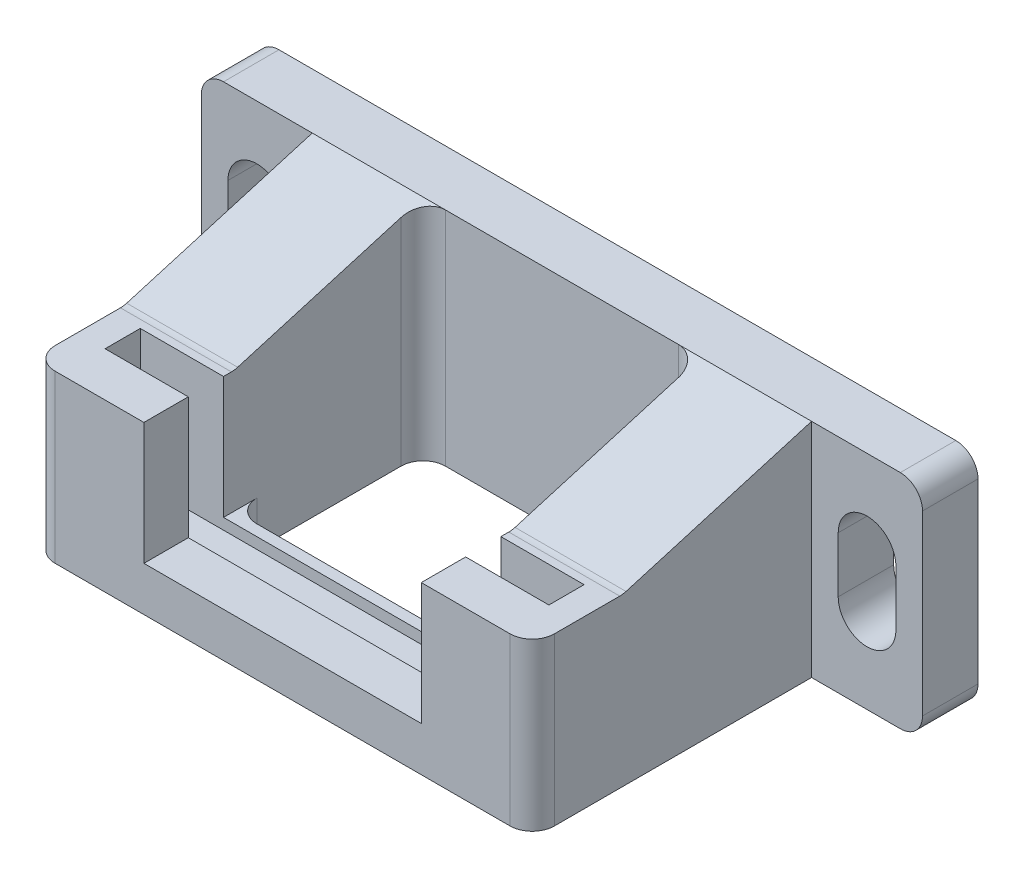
from build123d import *

# Parameters (mm, degrees)
BOSS_EXTRUDE1_DEPTH  = 25
BOSS_EXTRUDE2_DEPTH  = 10
CUT_EXTRUDE1_REACH   = 52.354
SKETCH3_W            = 25
SKETCH3_H            = 2
SKETCH8_W            = 40
SKETCH8_H            = 3.175
CUT_EXTRUDE4_DEPTH   = 12
SKETCH5_W            = 25
SKETCH5_H            = 17
CUT_EXTRUDE3_DEPTH   = 3.175
SKETCH6_W            = 10
SKETCH6_H            = 20
BOSS_EXTRUDE3_DEPTH  = 5
FILLET1_R            = 2
FILLET2_R            = 2
FILLET2_OF_MIRROR2_R = 2
SKETCH9_W            = 1.83173077
SKETCH9_H            = 0.488461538
CUT_EXTRUDE5_DEPTH   = 0.4


with BuildPart() as part:
    # Sketch1 → Boss-Extrude1 (new body)
    with BuildSketch(Plane(origin=(0, 0, 0), x_dir=(0, 0, -1), z_dir=(1, 0, 0))):
        Polygon((0, 20), (0, 0), (-30.175, 0), (-30.175, 6), (-26.175, 6), (-26.175, 3), (-23, 3), (-23, 6), (-22, 6), (-22, 3), (-5, 3), (-5, 20), align=None)
    extrude(amount=BOSS_EXTRUDE1_DEPTH)

    # Sketch2 → Boss-Extrude2 (add)
    with BuildSketch(Plane(origin=(25, 0, 0), x_dir=(0, 0, -1), z_dir=(1, 0, 0))):
        Polygon((-30.175, 15), (-22, 15), (-5, 20), (0, 20), (0, 0), (-30.175, 0), align=None)
    boss_extrude2 = extrude(amount=BOSS_EXTRUDE2_DEPTH)

    # Mirror1: Boss-Extrude2 across plane
    add(boss_extrude2.mirror(Plane(origin=(12.5, 0, 0), x_dir=(0, 0, 1), z_dir=(1, 0, 0))))

    # Cut-Extrude1: up to this face of the body (flat: up to its plane)
    cut_extrude1_end = Plane(part.part.faces().sort_by_distance((12.5, 4.5, 22))[0])
    # Sketch3 → Cut-Extrude1 (cut, up to the picked face)
    with BuildSketch(Plane.XY.offset(30.175), mode=Mode.PRIVATE) as cut_extrude1_sk1:
        with Locations((12.5, 5)):
            Rectangle(SKETCH3_W, SKETCH3_H)
    cut_extrude1_tool1 = split(extrude(cut_extrude1_sk1.sketch, amount=-CUT_EXTRUDE1_REACH, mode=Mode.PRIVATE), bisect_by=cut_extrude1_end, keep=Keep.BOTH, mode=Mode.PRIVATE)
    add(cut_extrude1_tool1.solids().sort_by(Axis((12.5, 5, 30.175), (0, 0, -1)))[0], mode=Mode.SUBTRACT)

    # Sketch8 → Cut-Extrude4 (cut)
    with BuildSketch(Plane(origin=(0, 15, 0), x_dir=(1, 0, 0), z_dir=(0, 1, 0))):
        with Locations((12.5, -24.5875)):
            Rectangle(SKETCH8_W, SKETCH8_H)
    extrude(amount=-CUT_EXTRUDE4_DEPTH, mode=Mode.SUBTRACT)

    # Sketch5 → Cut-Extrude3 (cut)
    with BuildSketch(Plane.XZ):
        with Locations((12.5, 13.5)):
            Rectangle(SKETCH5_W, SKETCH5_H)
    extrude(amount=-CUT_EXTRUDE3_DEPTH, mode=Mode.SUBTRACT)

    # Sketch6 → Boss-Extrude3 (add)
    with BuildSketch(Plane(origin=(0, 0, 0), x_dir=(-1, 0, 0), z_dir=(0, 0, -1))):
        with Locations((-40, 10)):
            Rectangle(SKETCH6_W, SKETCH6_H)
        with BuildLine():
            Line((-42.6, 7.5), (-42.6, 12.5))
            ThreePointArc((-42.6, 12.5), (-40, 15.1), (-37.4, 12.5))
            Line((-37.4, 12.5), (-37.4, 7.5))
            ThreePointArc((-37.4, 7.5), (-40, 4.9), (-42.6, 7.5))
        make_face(mode=Mode.SUBTRACT)
    boss_extrude3 = extrude(amount=-BOSS_EXTRUDE3_DEPTH)

    # Fillet1
    fillet1_edges = [part.edges().sort_by_distance(p)[0] for p in [
        (25, 2, 22),
        (0, 2, 22),
        (0, 10, 5),
        (30, 15, 22),
        (35, 7.5, 30.175),
        (-10, 7.5, 30.175),
        (-5, 15, 22),
        (25, 10, 5),
    ]]
    fillet(fillet1_edges, radius=FILLET1_R)

    # Fillet2
    fillet2_edges = [part.edges().sort_by_distance(p)[0] for p in [
        (45, 0, 2.5),
        (45, 20, 2.5),
    ]]
    fillet(fillet2_edges, radius=FILLET2_R)

    # Mirror2: Boss-Extrude3 across plane
    add(boss_extrude3.mirror(Plane(origin=(12.5, 0, 0), x_dir=(0, 0, 1), z_dir=(1, 0, 0))))

    # Fillet2 of Mirror2
    fillet2_of_mirror2_edges = [part.edges().sort_by_distance(p)[0] for p in [
        (-20, 0, 2.5),
        (-20, 20, 2.5),
    ]]
    fillet(fillet2_of_mirror2_edges, radius=FILLET2_OF_MIRROR2_R)

    # Sketch9 → Cut-Extrude5 (cut)
    # profile 1 of 6: a face of its own
    with BuildSketch(Plane.ZY.offset(10)):
        Polygon((5.366346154, 7.274038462), (5.366346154, 7.7625), (7.869711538, 7.7625), (5.871980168, 3.488461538), (7.808653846, 3.488461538), (7.808653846, 3), (5.183173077, 3), (7.180904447, 7.274038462), align=None)
    # profile 2 of 6: a face of its own
    with BuildSketch(Plane.ZY.offset(10)):
        Polygon((8.480288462, 7.7625), (8.922002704, 7.7625), (9.854086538, 4.269809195), (11.240286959, 7.7625), (11.302298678, 7.7625), (12.662740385, 4.293659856), (13.599594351, 7.7625), (14.036538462, 7.7625), (12.75241887, 3), (12.691361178, 3), (11.258413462, 6.642472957), (9.808293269, 3), (9.747235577, 3), align=None)
    # profile 3 of 6: a face of its own
    with BuildSketch(Plane.ZY.offset(10)):
        with BuildLine():
            Line((14.891346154, 7.7625), (15.825338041, 7.7625))
            add(Edge.make_bspline(
                [(15.825338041, 7.7625), (15.889578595, 7.762429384), (16.012666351, 7.762294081), (16.18917148, 7.758191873), (16.349476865, 7.752712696), (16.493236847, 7.745117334), (16.620893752, 7.736141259), (16.731869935, 7.723551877), (16.827037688, 7.710406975), (16.884060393, 7.697042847), (16.910066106, 7.690948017)],
                knots=[0, 0, 0, 0, 1.415646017, 2.712440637, 3.8905458, 4.950247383, 5.884950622, 6.709939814, 7.411656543, 8, 8, 8, 8], degree=3))
            add(Edge.make_bspline(
                [(16.910066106, 7.690948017), (16.942986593, 7.681937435), (17.008051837, 7.664128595), (17.10180647, 7.628459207), (17.191006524, 7.586165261), (17.275958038, 7.537963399), (17.355617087, 7.481785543), (17.431172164, 7.419908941), (17.501956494, 7.350904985), (17.567572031, 7.275547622), (17.627830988, 7.195101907), (17.679714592, 7.108366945), (17.723158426, 7.016802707), (17.760419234, 6.920472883), (17.78723681, 6.81856855), (17.807439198, 6.711797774), (17.820262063, 6.600171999), (17.821490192, 6.523890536), (17.822115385, 6.485058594)],
                knots=[0, 0, 0, 0, 0.999701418, 1.975846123, 2.934577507, 3.890451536, 4.834027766, 5.787354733, 6.749476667, 7.726910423, 8.712836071, 9.690891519, 10.682875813, 11.679750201, 12.712814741, 13.765529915, 14.8625177, 16, 16, 16, 16], degree=3))
            add(Edge.make_bspline(
                [(17.822115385, 6.485058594), (17.821541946, 6.445900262), (17.820419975, 6.36928434), (17.806953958, 6.257198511), (17.788815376, 6.150085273), (17.760924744, 6.048182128), (17.724395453, 5.95209424), (17.681543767, 5.860353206), (17.629859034, 5.774519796), (17.570470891, 5.694282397), (17.504406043, 5.619565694), (17.431944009, 5.550911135), (17.353377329, 5.488720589), (17.268955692, 5.432854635), (17.177856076, 5.384608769), (17.081460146, 5.341396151), (16.97893003, 5.305104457), (16.907978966, 5.286013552), (16.871905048, 5.276307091)],
                knots=[0, 0, 0, 0, 1.121902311, 2.195077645, 3.232258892, 4.234102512, 5.217864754, 6.176164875, 7.132989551, 8.084763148, 9.034132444, 9.988522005, 10.94243251, 11.903244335, 12.886203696, 13.894208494, 14.929344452, 16, 16, 16, 16], degree=3))
            add(Edge.make_bspline(
                [(16.871905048, 5.276307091), (16.842068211, 5.269962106), (16.776679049, 5.256056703), (16.668988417, 5.240533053), (16.543604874, 5.22728296), (16.400699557, 5.217348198), (16.24040074, 5.208843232), (16.062621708, 5.202083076), (15.867013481, 5.198368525), (15.730572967, 5.198176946), (15.65933744, 5.198076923)],
                knots=[0, 0, 0, 0, 0.601384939, 1.31797006, 2.144135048, 3.087295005, 4.142315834, 5.309527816, 6.595305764, 8, 8, 8, 8], degree=3))
            Line((15.65933744, 5.198076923), (15.31875, 5.198076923))
            Line((15.31875, 5.198076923), (15.31875, 3))
            Line((15.31875, 3), (14.891346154, 3))
            Line((14.891346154, 3), (14.891346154, 7.7625))
        make_face()
        with BuildLine():
            Line((15.31875, 7.274038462), (15.31875, 5.686538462))
            Line((15.31875, 5.686538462), (16.152569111, 5.676044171))
            add(Edge.make_bspline(
                [(16.152569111, 5.676044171), (16.193281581, 5.676023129), (16.271876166, 5.675982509), (16.385409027, 5.681405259), (16.49074095, 5.68766527), (16.58754839, 5.696830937), (16.675874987, 5.709786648), (16.755868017, 5.722865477), (16.826907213, 5.741786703), (16.910045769, 5.767263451), (17.002687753, 5.810714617), (17.103472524, 5.873783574), (17.188885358, 5.954175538), (17.26279704, 6.044564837), (17.321451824, 6.145120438), (17.364390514, 6.25271067), (17.389619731, 6.366232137), (17.393002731, 6.443912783), (17.394711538, 6.483150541)],
                knots=[0, 0, 0, 0, 1.160613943, 2.240541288, 3.23993089, 4.169200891, 5.011653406, 5.7853311, 6.478053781, 7.106038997, 8.262395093, 9.384106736, 10.481365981, 11.59014053, 12.70357646, 13.786202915, 14.881775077, 16, 16, 16, 16], degree=3))
            add(Edge.make_bspline(
                [(17.394711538, 6.483150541), (17.392993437, 6.521439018), (17.389578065, 6.597551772), (17.364192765, 6.709101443), (17.321535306, 6.815557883), (17.262403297, 6.914853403), (17.190637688, 7.004917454), (17.107226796, 7.083154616), (17.012366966, 7.146049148), (16.924127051, 7.18664372), (16.845748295, 7.211429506), (16.777669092, 7.228771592), (16.700801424, 7.242617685), (16.615120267, 7.253829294), (16.521289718, 7.263427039), (16.418503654, 7.269939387), (16.307151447, 7.273751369), (16.229848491, 7.273940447), (16.189776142, 7.274038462)],
                knots=[0, 0, 0, 0, 1.120700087, 2.227813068, 3.331159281, 4.466773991, 5.599788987, 6.693661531, 7.80175334, 8.91857717, 9.525282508, 10.207424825, 10.974604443, 11.810962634, 12.737642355, 13.736264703, 14.826523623, 16, 16, 16, 16], degree=3))
            Line((16.189776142, 7.274038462), (15.31875, 7.274038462))
        make_face(mode=Mode.SUBTRACT)
    # profile 4 of 6: a face of its own
    with BuildSketch(Plane.ZY.offset(10)):
        with Locations((19.2875, 4.831730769)):
            Rectangle(SKETCH9_W, SKETCH9_H)
    # profile 5 of 6: a face of its own
    with BuildSketch(Plane.ZY.offset(10)):
        with BuildLine():
            add(Edge.make_bspline(
                [(20.569711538, 5.379341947), (20.570157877, 5.455674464), (20.571024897, 5.603951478), (20.580670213, 5.820012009), (20.59669309, 6.022704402), (20.618651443, 6.21203836), (20.645373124, 6.388062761), (20.681044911, 6.550307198), (20.721611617, 6.699522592), (20.768627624, 6.836195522), (20.821678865, 6.962167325), (20.87941977, 7.079767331), (20.944141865, 7.188817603), (21.012146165, 7.291058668), (21.086185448, 7.38481691), (21.164152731, 7.47141639), (21.249091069, 7.548855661), (21.338113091, 7.619403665), (21.43202478, 7.681247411), (21.528149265, 7.73572053), (21.627148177, 7.782256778), (21.729291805, 7.818846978), (21.833662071, 7.849069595), (21.94062383, 7.869737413), (22.050353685, 7.882741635), (22.124419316, 7.883984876), (22.161981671, 7.884615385)],
                knots=[0, 0, 0, 0, 1.646270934, 3.197905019, 4.663502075, 6.030701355, 7.308322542, 8.50163776, 9.611534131, 10.641858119, 11.616356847, 12.558055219, 13.465016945, 14.349605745, 15.204443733, 16.039544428, 16.859896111, 17.680448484, 18.487036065, 19.28249412, 20.06191084, 20.843045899, 21.620316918, 22.403196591, 23.190181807, 24, 24, 24, 24], degree=3))
            add(Edge.make_bspline(
                [(22.161981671, 7.884615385), (22.199857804, 7.883951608), (22.275181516, 7.882631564), (22.386542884, 7.869944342), (22.495331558, 7.848892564), (22.601083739, 7.81906438), (22.704668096, 7.782058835), (22.805274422, 7.735676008), (22.90352763, 7.681684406), (22.997866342, 7.61824263), (23.08932623, 7.547509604), (23.175660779, 7.467550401), (23.25687785, 7.37917239), (23.333996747, 7.28332114), (23.404829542, 7.178158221), (23.47228482, 7.0655127), (23.532662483, 6.94341463), (23.590812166, 6.813901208), (23.641004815, 6.673388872), (23.686270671, 6.52266968), (23.722845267, 6.359963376), (23.75331067, 6.186123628), (23.776912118, 6.000512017), (23.794101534, 5.803526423), (23.803181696, 5.595037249), (23.804891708, 5.452491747), (23.805769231, 5.379341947)],
                knots=[0, 0, 0, 0, 0.810914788, 1.612654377, 2.396697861, 3.181598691, 3.963628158, 4.749916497, 5.551656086, 6.361998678, 7.18212741, 8.025565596, 8.878627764, 9.750805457, 10.657531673, 11.591944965, 12.560506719, 13.57287815, 14.630710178, 15.753379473, 16.941251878, 18.199788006, 19.531962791, 20.947069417, 22.433333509, 24, 24, 24, 24], degree=3))
            add(Edge.make_bspline(
                [(23.805769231, 5.379341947), (23.80488261, 5.306511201), (23.803155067, 5.164603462), (23.794203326, 4.957052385), (23.776570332, 4.76111219), (23.754513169, 4.576312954), (23.723963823, 4.403423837), (23.686401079, 4.24184657), (23.644694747, 4.090883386), (23.593212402, 3.951771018), (23.536864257, 3.822568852), (23.475557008, 3.701918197), (23.409875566, 3.588752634), (23.338317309, 3.483977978), (23.262044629, 3.38685202), (23.179425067, 3.299089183), (23.092787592, 3.218574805), (23.001058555, 3.146930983), (22.905248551, 3.084222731), (22.807332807, 3.028142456), (22.705573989, 2.982922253), (22.60227815, 2.944094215), (22.495967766, 2.914430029), (22.386775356, 2.893918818), (22.275256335, 2.879533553), (22.199870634, 2.878436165), (22.161981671, 2.877884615)],
                knots=[0, 0, 0, 0, 1.561518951, 3.042555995, 4.452378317, 5.7783523, 7.031515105, 8.214008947, 9.334062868, 10.386615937, 11.391082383, 12.354592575, 13.286541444, 14.194233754, 15.072674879, 15.931287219, 16.775624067, 17.606195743, 18.42308326, 19.229000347, 20.022332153, 20.807536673, 21.593273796, 22.3848459, 23.188221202, 24, 24, 24, 24], degree=3))
            add(Edge.make_bspline(
                [(22.161981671, 2.877884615), (22.124420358, 2.878519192), (22.050356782, 2.879770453), (21.940611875, 2.892715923), (21.834091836, 2.913528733), (21.730271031, 2.942670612), (21.628616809, 2.978341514), (21.530514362, 3.02481492), (21.434872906, 3.078337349), (21.34194761, 3.139291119), (21.253484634, 3.209125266), (21.168986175, 3.286365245), (21.090574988, 3.37293853), (21.017594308, 3.467478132), (20.948233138, 3.569114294), (20.884430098, 3.679234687), (20.825414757, 3.797402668), (20.771471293, 3.924381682), (20.723644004, 4.062024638), (20.681396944, 4.211906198), (20.64804018, 4.37534926), (20.619488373, 4.551041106), (20.596459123, 4.739736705), (20.580736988, 4.941538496), (20.571019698, 5.156320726), (20.570155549, 5.303644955), (20.569711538, 5.379341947)],
                knots=[0, 0, 0, 0, 0.810891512, 1.598919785, 2.382837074, 3.152667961, 3.926044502, 4.706494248, 5.493654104, 6.291793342, 7.103789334, 7.925228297, 8.761435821, 9.622817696, 10.50288917, 11.416980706, 12.369136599, 13.353924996, 14.394355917, 15.514179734, 16.714354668, 17.994756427, 19.357759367, 20.818452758, 22.365282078, 24, 24, 24, 24], degree=3))
        make_face()
        with BuildLine():
            add(Edge.make_bspline(
                [(20.997115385, 5.38125), (20.997277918, 5.317638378), (20.997593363, 5.19418071), (21.005834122, 5.014779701), (21.01706033, 4.847452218), (21.031540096, 4.691985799), (21.053043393, 4.548906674), (21.077137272, 4.417230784), (21.106458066, 4.297654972), (21.141149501, 4.189358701), (21.180663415, 4.090504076), (21.223806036, 3.998518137), (21.270152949, 3.912314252), (21.322022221, 3.832666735), (21.378512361, 3.759315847), (21.438347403, 3.690963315), (21.503760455, 3.630007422), (21.594253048, 3.556900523), (21.713718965, 3.481354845), (21.864241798, 3.415569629), (22.018912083, 3.374227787), (22.123892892, 3.368970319), (22.176292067, 3.366346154)],
                knots=[0, 0, 0, 0, 1.459021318, 2.831673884, 4.118529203, 5.306027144, 6.411944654, 7.436330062, 8.375795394, 9.233974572, 10.042671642, 10.816086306, 11.563610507, 12.285937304, 12.993564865, 13.685989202, 14.367179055, 15.041617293, 16.353048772, 17.594441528, 18.799311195, 20, 20, 20, 20], degree=3))
            add(Edge.make_bspline(
                [(22.176292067, 3.366346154), (22.229030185, 3.368520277), (22.334397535, 3.372864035), (22.488340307, 3.414772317), (22.637787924, 3.478004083), (22.754907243, 3.552771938), (22.844010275, 3.623975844), (22.907850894, 3.684683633), (22.966446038, 3.752659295), (23.022020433, 3.826000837), (23.072991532, 3.906109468), (23.119341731, 3.992599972), (23.161637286, 4.085712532), (23.185734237, 4.150713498), (23.198054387, 4.183946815)],
                knots=[0, 0, 0, 0, 1.353760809, 2.704726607, 4.075137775, 5.516104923, 6.260822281, 7.007110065, 7.778089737, 8.566572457, 9.372053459, 10.217411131, 11.088608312, 12, 12, 12, 12], degree=3))
            add(Edge.make_bspline(
                [(23.198054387, 4.183946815), (23.212412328, 4.226441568), (23.241565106, 4.31272414), (23.279136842, 4.446568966), (23.308726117, 4.586998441), (23.335346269, 4.733173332), (23.353515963, 4.88617164), (23.368140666, 5.045519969), (23.376754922, 5.211338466), (23.377822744, 5.323998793), (23.378365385, 5.38125)],
                knots=[0, 0, 0, 0, 0.884706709, 1.796334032, 2.740027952, 3.714592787, 4.726048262, 5.777819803, 6.87074269, 8, 8, 8, 8], degree=3))
            add(Edge.make_bspline(
                [(23.378365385, 5.38125), (23.377616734, 5.438491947), (23.376152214, 5.550469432), (23.370554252, 5.714460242), (23.356098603, 5.870218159), (23.340043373, 6.018414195), (23.316370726, 6.158228), (23.29084671, 6.290830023), (23.25655506, 6.414577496), (23.219924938, 6.531407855), (23.178000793, 6.639993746), (23.131851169, 6.740841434), (23.082563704, 6.834437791), (23.029030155, 6.920526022), (22.97188603, 6.999491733), (22.909623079, 7.069751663), (22.844711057, 7.133483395), (22.753791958, 7.206230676), (22.634764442, 7.280405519), (22.486656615, 7.348666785), (22.332527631, 7.38786664), (22.228333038, 7.393393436), (22.176292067, 7.396153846)],
                knots=[0, 0, 0, 0, 1.31362396, 2.569729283, 3.763502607, 4.902122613, 5.988968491, 7.01645872, 7.998833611, 8.933434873, 9.825090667, 10.667526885, 11.477055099, 12.250526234, 12.991942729, 13.710640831, 14.402115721, 15.076753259, 16.378508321, 17.609869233, 18.806226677, 20, 20, 20, 20], degree=3))
            add(Edge.make_bspline(
                [(22.176292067, 7.396153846), (22.123618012, 7.393389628), (22.018173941, 7.387856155), (21.862442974, 7.348812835), (21.713166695, 7.280759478), (21.594453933, 7.205984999), (21.503471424, 7.134767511), (21.43940533, 7.073009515), (21.379335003, 7.005455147), (21.323997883, 6.931429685), (21.272169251, 6.851875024), (21.224570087, 6.766165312), (21.181684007, 6.673866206), (21.142108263, 6.575055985), (21.107311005, 6.466769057), (21.078608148, 6.347340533), (21.052091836, 6.216083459), (21.033320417, 6.072229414), (21.016632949, 5.916724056), (21.005908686, 5.748978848), (20.997565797, 5.569276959), (20.997268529, 5.445180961), (20.997115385, 5.38125)],
                knots=[0, 0, 0, 0, 1.207732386, 2.417664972, 3.655092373, 4.956220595, 5.625982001, 6.301752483, 6.994047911, 7.697131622, 8.419323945, 9.170223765, 9.943494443, 10.752040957, 11.610060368, 12.549350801, 13.567764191, 14.679664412, 15.874934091, 17.154273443, 18.533957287, 20, 20, 20, 20], degree=3))
        make_face(mode=Mode.SUBTRACT)
    # profile 6 of 6: a face of its own
    with BuildSketch(Plane.ZY.offset(10)):
        with BuildLine():
            Line((24.84375, 6.297115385), (24.416346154, 6.297115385))
            add(Edge.make_bspline(
                [(24.416346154, 6.297115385), (24.419131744, 6.353817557), (24.424602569, 6.465179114), (24.450222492, 6.627544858), (24.486881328, 6.782740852), (24.538712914, 6.929520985), (24.603083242, 7.069183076), (24.6802766, 7.201172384), (24.771708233, 7.324985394), (24.875403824, 7.43947432), (24.988028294, 7.54450455), (25.109548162, 7.635203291), (25.237244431, 7.711835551), (25.370729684, 7.77589967), (25.511509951, 7.823987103), (25.658307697, 7.859667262), (25.811767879, 7.881134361), (25.916325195, 7.883441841), (25.969501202, 7.884615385)],
                knots=[0, 0, 0, 0, 1.10065271, 2.161652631, 3.183658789, 4.190468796, 5.17591951, 6.163126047, 7.15150782, 8.156236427, 9.156009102, 10.134482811, 11.092018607, 12.041330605, 13.001268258, 13.972401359, 14.968799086, 16, 16, 16, 16], degree=3))
            add(Edge.make_bspline(
                [(25.969501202, 7.884615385), (26.021722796, 7.883392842), (26.124336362, 7.88099059), (26.274099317, 7.860360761), (26.416671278, 7.828049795), (26.551773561, 7.782717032), (26.678328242, 7.721778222), (26.797286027, 7.648575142), (26.91006313, 7.563911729), (27.011581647, 7.464234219), (27.104801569, 7.357823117), (27.185222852, 7.244219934), (27.254092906, 7.126886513), (27.311498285, 7.004928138), (27.353756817, 6.877196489), (27.385840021, 6.745551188), (27.403974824, 6.60862957), (27.406758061, 6.515956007), (27.408173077, 6.468840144)],
                knots=[0, 0, 0, 0, 1.111607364, 2.184268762, 3.212621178, 4.221274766, 5.211760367, 6.196651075, 7.1921475, 8.207485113, 9.220403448, 10.201281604, 11.166441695, 12.114753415, 13.065576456, 14.026450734, 14.996634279, 16, 16, 16, 16], degree=3))
            add(Edge.make_bspline(
                [(27.408173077, 6.468840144), (27.40586903, 6.402508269), (27.401301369, 6.27100855), (27.362229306, 6.077766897), (27.301206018, 5.890541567), (27.227731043, 5.739859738), (27.15360961, 5.618438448), (27.086815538, 5.518468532), (27.008622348, 5.410828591), (26.917891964, 5.295879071), (26.816501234, 5.172719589), (26.70353179, 5.041424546), (26.578178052, 4.903350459), (26.490196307, 4.809045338), (26.44460637, 4.760178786)],
                knots=[0, 0, 0, 0, 1.184426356, 2.348067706, 3.509069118, 4.696110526, 5.333549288, 6.050745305, 6.844228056, 7.710549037, 8.667450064, 9.695053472, 10.805634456, 12, 12, 12, 12], degree=3))
            Line((26.44460637, 4.760178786), (25.253027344, 3.488461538))
            Line((25.253027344, 3.488461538), (27.469230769, 3.488461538))
            Line((27.469230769, 3.488461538), (27.469230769, 3))
            Line((27.469230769, 3), (24.233173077, 3))
            Line((24.233173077, 3), (26.080168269, 4.97101863))
            add(Edge.make_bspline(
                [(26.080168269, 4.97101863), (26.125137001, 5.017960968), (26.211512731, 5.108127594), (26.333681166, 5.239767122), (26.44340779, 5.361890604), (26.541402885, 5.4742673), (26.625540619, 5.578540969), (26.700206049, 5.671334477), (26.760030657, 5.756725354), (26.824957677, 5.855704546), (26.887841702, 5.976552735), (26.941878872, 6.124236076), (26.974828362, 6.276264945), (26.978781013, 6.379001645), (26.980769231, 6.430679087)],
                knots=[0, 0, 0, 0, 1.329631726, 2.553950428, 3.673215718, 4.687767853, 5.603093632, 6.413772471, 7.123043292, 7.734684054, 8.834405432, 9.900288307, 10.943827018, 12, 12, 12, 12], degree=3))
            add(Edge.make_bspline(
                [(26.980769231, 6.430679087), (26.979904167, 6.463174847), (26.978199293, 6.527217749), (26.963152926, 6.621114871), (26.940414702, 6.711690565), (26.907832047, 6.799223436), (26.864824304, 6.882833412), (26.812473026, 6.962622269), (26.752070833, 7.039759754), (26.682196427, 7.112086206), (26.605436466, 7.178327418), (26.52434572, 7.237006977), (26.438552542, 7.28604591), (26.348418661, 7.326246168), (26.254195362, 7.357781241), (26.155700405, 7.379632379), (26.05320594, 7.393351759), (25.983219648, 7.395208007), (25.947558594, 7.396153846)],
                knots=[0, 0, 0, 0, 0.991446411, 1.95395049, 2.89581595, 3.838931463, 4.798493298, 5.75982156, 6.748411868, 7.785213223, 8.824556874, 9.840280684, 10.836137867, 11.835679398, 12.848801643, 13.863922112, 14.911575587, 16, 16, 16, 16], degree=3))
            add(Edge.make_bspline(
                [(25.947558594, 7.396153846), (25.910314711, 7.395180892), (25.837173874, 7.393270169), (25.729787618, 7.37990433), (25.627345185, 7.356845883), (25.529588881, 7.325309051), (25.436353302, 7.285224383), (25.348091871, 7.235297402), (25.265002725, 7.175720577), (25.18692967, 7.108173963), (25.114996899, 7.032970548), (25.051795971, 6.949136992), (24.996572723, 6.858203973), (24.948390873, 6.760416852), (24.909262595, 6.654888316), (24.879363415, 6.541992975), (24.855704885, 6.422221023), (24.847801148, 6.33950989), (24.84375, 6.297115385)],
                knots=[0, 0, 0, 0, 1.031018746, 2.02475058, 2.990194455, 3.934040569, 4.864654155, 5.795059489, 6.735614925, 7.690564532, 8.649604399, 9.611025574, 10.590972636, 11.591080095, 12.624614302, 13.701020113, 14.821632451, 16, 16, 16, 16], degree=3))
        make_face()
    extrude(amount=-CUT_EXTRUDE5_DEPTH, mode=Mode.SUBTRACT)


solid = part.part
